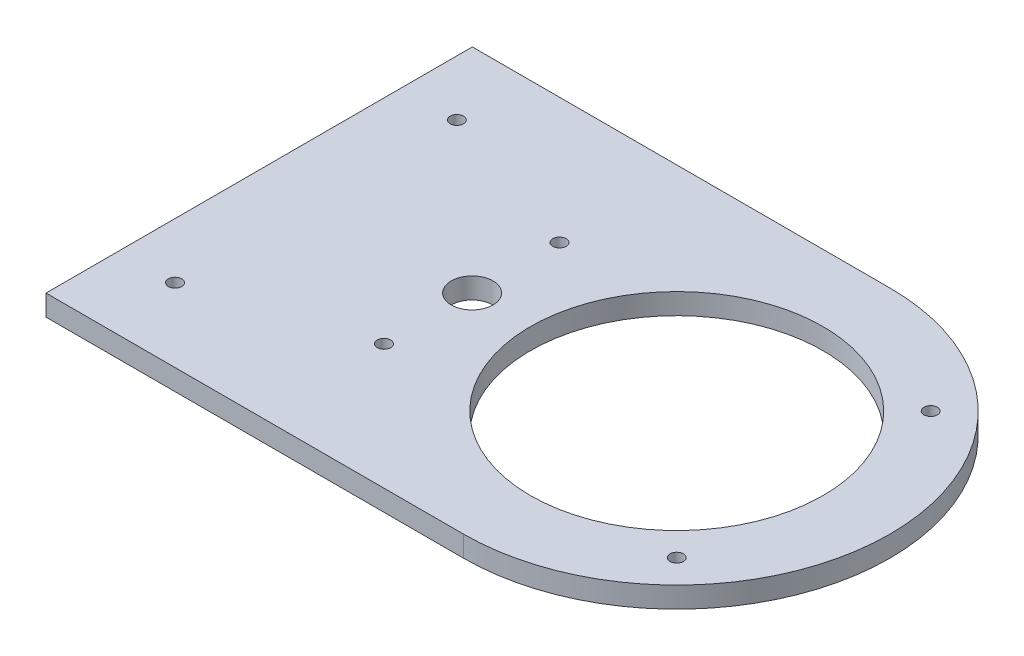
from build123d import *

# Parameters (mm, degrees)
SKETCH1_W                                           = 178
SKETCH1_H                                           = 102.1
SKETCH1_R                                           = 35.05
SKETCH1_R_2                                         = 5
BOSS_EXTRUDE1_DEPTH                                 = 5
CSK_FOR_M3_COUNTERSUNK_FLAT_HEAD_SCREW1_D           = 3.2
CSK_FOR_M3_COUNTERSUNK_FLAT_HEAD_SCREW1_CSINK_D     = 6.3
CSK_FOR_M3_COUNTERSUNK_FLAT_HEAD_SCREW1_CSINK_ANGLE = 90
CUT_EXTRUDE2_DEPTH                                  = 113.388177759
CSK_FOR_M3_COUNTERSUNK_FLAT_HEAD_SCREW2_D           = 3.2
CSK_FOR_M3_COUNTERSUNK_FLAT_HEAD_SCREW2_CSINK_D     = 6.3
CSK_FOR_M3_COUNTERSUNK_FLAT_HEAD_SCREW2_CSINK_ANGLE = 90
CSK_FOR_M3_COUNTERSUNK_FLAT_HEAD_SCREW3_D           = 3.2
CSK_FOR_M3_COUNTERSUNK_FLAT_HEAD_SCREW3_CSINK_D     = 6.3
CSK_FOR_M3_COUNTERSUNK_FLAT_HEAD_SCREW3_CSINK_ANGLE = 90


with BuildPart() as part:
    # Sketch1 → Boss-Extrude1 (new body)
    with BuildSketch(Plane(origin=(0, 0, 0), x_dir=(1, 0, 0), z_dir=(0, 1, 0))):
        with Locations((-11, 0)):
            Rectangle(SKETCH1_W, SKETCH1_H)
        with Locations(Location((0, 0, 0), (0, 0, 270))):
            Circle(SKETCH1_R, mode=Mode.SUBTRACT)
        with Locations(Location((-49, 0, 0), (0, 0, 270))):
            Circle(SKETCH1_R_2, mode=Mode.SUBTRACT)
    extrude(amount=BOSS_EXTRUDE1_DEPTH)

    # CSK for M3 Countersunk Flat Head Screw1 (through all)
    with Locations(Plane(origin=(0, 0, 0), x_dir=(-1, 0, 0), z_dir=(0, -1, 0))):
        with Locations((-30.405591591, -30.405591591), (-30.405591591, 30.405591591)):
            CounterSinkHole(CSK_FOR_M3_COUNTERSUNK_FLAT_HEAD_SCREW1_D / 2, CSK_FOR_M3_COUNTERSUNK_FLAT_HEAD_SCREW1_CSINK_D / 2, counter_sink_angle=CSK_FOR_M3_COUNTERSUNK_FLAT_HEAD_SCREW1_CSINK_ANGLE)

    # Sketch12 → Cut-Extrude2 (cut, through all)
    with BuildSketch(Plane(origin=(0, 5, 0), x_dir=(1, 0, 0), z_dir=(0, 1, 0))):
        with BuildLine():
            Line((0, 51.05), (78, 51.05))
            Line((78, 51.05), (78, -51.05))
            Line((78, -51.05), (0, -51.05))
            ThreePointArc((0, -51.05), (51.05, 0), (0, 51.05))
        make_face()
    extrude(amount=-CUT_EXTRUDE2_DEPTH, mode=Mode.SUBTRACT)

    # CSK for M3 Countersunk Flat Head Screw2 (through all)
    with Locations(Plane(origin=(0, 0, 0), x_dir=(-1, 0, 0), z_dir=(0, -1, 0))):
        with Locations((49, 20.91), (49, -21.11)):
            CounterSinkHole(CSK_FOR_M3_COUNTERSUNK_FLAT_HEAD_SCREW2_D / 2, CSK_FOR_M3_COUNTERSUNK_FLAT_HEAD_SCREW2_CSINK_D / 2, counter_sink_angle=CSK_FOR_M3_COUNTERSUNK_FLAT_HEAD_SCREW2_CSINK_ANGLE)

    # CSK for M3 Countersunk Flat Head Screw3 (through all)
    with Locations(Plane(origin=(0, 0, 0), x_dir=(-1, 0, 0), z_dir=(0, -1, 0))):
        with Locations((86.7, 34.05), (86.7, -33.45)):
            CounterSinkHole(CSK_FOR_M3_COUNTERSUNK_FLAT_HEAD_SCREW3_D / 2, CSK_FOR_M3_COUNTERSUNK_FLAT_HEAD_SCREW3_CSINK_D / 2, counter_sink_angle=CSK_FOR_M3_COUNTERSUNK_FLAT_HEAD_SCREW3_CSINK_ANGLE)


solid = part.part
